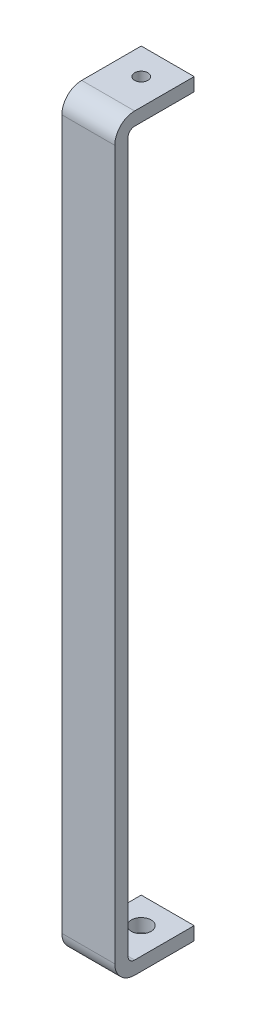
from build123d import *

# Parameters (mm, degrees)
EXTRUDE1_DEPTH      = 3.175
EXTRUDE1_DEPTH_BACK = 12.7
SKETCH1_W           = 12.7
SKETCH1_H           = 3.175
SKETCH2_W           = 12.7
SKETCH2_H           = 179.578
EXTRUDE2_DEPTH      = 3.175
SKETCH3_W           = 12.7
SKETCH3_H           = 3.175
EXTRUDE3_DEPTH      = 15.875
SKETCH4_R           = 2.3749
CUT_EXTRUDE1_DEPTH  = 12.7
SKETCH5_R           = 1.5875
CUT_EXTRUDE2_DEPTH  = 12.7
FILLET1_R           = 1.5875
FILLET2_R           = 4.7625


with BuildPart() as part:
    # Sketch1 → Extrude1 (new, two sides: drawn at the far end of the back side and taken through both)
    with BuildSketch(Plane.XY.offset(-EXTRUDE1_DEPTH_BACK)):
        with Locations((-7.9375, 5.2705)):
            Rectangle(SKETCH1_W, SKETCH1_H)
    extrude(amount=EXTRUDE1_DEPTH + EXTRUDE1_DEPTH_BACK)

    # Sketch2 → Extrude2 (add)
    with BuildSketch(Plane.XY.offset(3.175)):
        with Locations((-7.9375, -82.931)):
            Rectangle(SKETCH2_W, SKETCH2_H)
    extrude(amount=EXTRUDE2_DEPTH)

    # Sketch3 → Extrude3 (add)
    with BuildSketch(Plane(origin=(0, 0, 3.175), x_dir=(-1, 0, 0), z_dir=(0, 0, -1))):
        with Locations((7.9375, -171.1325)):
            Rectangle(SKETCH3_W, SKETCH3_H)
    extrude(amount=EXTRUDE3_DEPTH)

    # Sketch4 → Cut-Extrude1 (cut)
    with BuildSketch(Plane.XZ.offset(172.72)):
        with Locations(Location((-7.9375, -6.35, 0), (0, 0, 270))):
            Circle(SKETCH4_R)
    extrude(amount=-CUT_EXTRUDE1_DEPTH, mode=Mode.SUBTRACT)

    # Sketch5 → Cut-Extrude2 (cut)
    with BuildSketch(Plane(origin=(0, 6.858, 0), x_dir=(-1, 0, 0), z_dir=(0, 1, 0))):
        with Locations(Location((7.9375, -6.35, 0), (0, 0, 90))):
            Circle(SKETCH5_R)
    extrude(amount=-CUT_EXTRUDE2_DEPTH, mode=Mode.SUBTRACT)

    # Fillet1
    fillet1_edges = [part.edges().sort_by_distance(p)[0] for p in [
        (-7.9375, 3.683, 3.175),
        (-7.9375, -169.545, 3.175),
    ]]
    fillet(fillet1_edges, radius=FILLET1_R)

    # Fillet2
    fillet2_edges = [part.edges().sort_by_distance(p)[0] for p in [
        (-7.9375, -172.72, 6.35),
        (-7.9375, 6.858, 6.35),
    ]]
    fillet(fillet2_edges, radius=FILLET2_R)


solid = part.part
